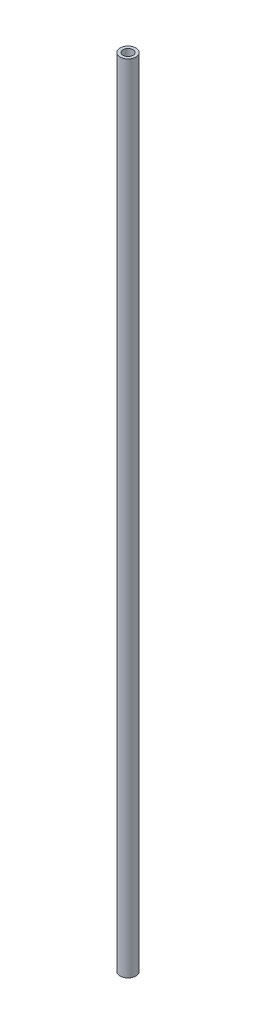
ISO-10303-21;
HEADER;
FILE_DESCRIPTION(('STEP AP214'),'2;1');
FILE_NAME('part.step','',(''),(''),'','','');
FILE_SCHEMA(('AUTOMOTIVE_DESIGN { 1 0 10303 214 1 1 1 1 }'));
ENDSEC;
DATA;
#1=APPLICATION_CONTEXT('core data for automotive mechanical design processes');
#2=APPLICATION_PROTOCOL_DEFINITION('international standard','automotive_design',2000,#1);
#3=PRODUCT_CONTEXT('',#1,'mechanical');
#4=PRODUCT('Part','Part','',(#3));
#5=PRODUCT_RELATED_PRODUCT_CATEGORY('part','',(#4));
#6=PRODUCT_DEFINITION_FORMATION('','',#4);
#7=PRODUCT_DEFINITION_CONTEXT('part definition',#1,'design');
#8=PRODUCT_DEFINITION('design','',#6,#7);
#9=PRODUCT_DEFINITION_SHAPE('','',#8);
#10=(LENGTH_UNIT() NAMED_UNIT(*) SI_UNIT(.MILLI.,.METRE.));
#11=(NAMED_UNIT(*) PLANE_ANGLE_UNIT() SI_UNIT($,.RADIAN.));
#12=(NAMED_UNIT(*) SI_UNIT($,.STERADIAN.) SOLID_ANGLE_UNIT());
#13=UNCERTAINTY_MEASURE_WITH_UNIT(LENGTH_MEASURE(1.E-05),#10,'distance_accuracy_value','');
#14=(GEOMETRIC_REPRESENTATION_CONTEXT(3) GLOBAL_UNCERTAINTY_ASSIGNED_CONTEXT((#13)) GLOBAL_UNIT_ASSIGNED_CONTEXT((#10,
#11,#12)) REPRESENTATION_CONTEXT('',''));
#15=CARTESIAN_POINT('',(0.,0.,0.));
#16=DIRECTION('',(0.,0.,1.));
#17=DIRECTION('',(1.,0.,0.));
#18=AXIS2_PLACEMENT_3D('',#15,#16,#17);
#19=CARTESIAN_POINT('',(0.,400.,0.));
#20=DIRECTION('',(0.,-1.,0.));
#21=DIRECTION('',(0.,0.,-1.));
#22=AXIS2_PLACEMENT_3D('',#19,#20,#21);
#23=CYLINDRICAL_SURFACE('',#22,4.);
#24=CARTESIAN_POINT('',(0.,400.,0.));
#25=DIRECTION('',(0.,1.,0.));
#26=DIRECTION('',(0.,0.,1.));
#27=AXIS2_PLACEMENT_3D('',#24,#25,#26);
#28=CIRCLE('',#27,4.);
#29=CARTESIAN_POINT('',(0.,400.,4.));
#30=VERTEX_POINT('',#29);
#31=EDGE_CURVE('E10',#30,#30,#28,.T.);
#32=ORIENTED_EDGE('',*,*,#31,.F.);
#33=EDGE_LOOP('',(#32));
#34=FACE_BOUND('',#33,.T.);
#35=CARTESIAN_POINT('',(0.,0.,0.));
#36=DIRECTION('',(0.,1.,0.));
#37=DIRECTION('',(0.,0.,1.));
#38=AXIS2_PLACEMENT_3D('',#35,#36,#37);
#39=CIRCLE('',#38,4.);
#40=CARTESIAN_POINT('',(0.,0.,4.));
#41=VERTEX_POINT('',#40);
#42=EDGE_CURVE('E43',#41,#41,#39,.T.);
#43=ORIENTED_EDGE('',*,*,#42,.T.);
#44=EDGE_LOOP('',(#43));
#45=FACE_BOUND('',#44,.T.);
#46=ADVANCED_FACE('F40',(#34,#45),#23,.T.);
#47=CARTESIAN_POINT('',(0.,400.,0.));
#48=DIRECTION('',(0.,1.,0.));
#49=DIRECTION('',(0.,0.,1.));
#50=AXIS2_PLACEMENT_3D('',#47,#48,#49);
#51=PLANE('',#50);
#52=CARTESIAN_POINT('',(0.,400.,0.));
#53=DIRECTION('',(0.,1.,0.));
#54=DIRECTION('',(0.,0.,1.));
#55=AXIS2_PLACEMENT_3D('',#52,#53,#54);
#56=CIRCLE('',#55,2.5);
#57=CARTESIAN_POINT('',(0.,400.,2.5));
#58=VERTEX_POINT('',#57);
#59=EDGE_CURVE('E52',#58,#58,#56,.T.);
#60=ORIENTED_EDGE('',*,*,#59,.F.);
#61=EDGE_LOOP('',(#60));
#62=FACE_BOUND('',#61,.T.);
#63=ORIENTED_EDGE('',*,*,#31,.T.);
#64=EDGE_LOOP('',(#63));
#65=FACE_BOUND('',#64,.T.);
#66=ADVANCED_FACE('F67',(#62,#65),#51,.T.);
#67=CARTESIAN_POINT('',(0.,0.,0.));
#68=DIRECTION('',(0.,1.,0.));
#69=DIRECTION('',(0.,0.,1.));
#70=AXIS2_PLACEMENT_3D('',#67,#68,#69);
#71=PLANE('',#70);
#72=ORIENTED_EDGE('',*,*,#42,.F.);
#73=EDGE_LOOP('',(#72));
#74=FACE_BOUND('',#73,.T.);
#75=ADVANCED_FACE('F63',(#74),#71,.F.);
#76=CARTESIAN_POINT('',(0.,395.,0.));
#77=DIRECTION('',(0.,1.,0.));
#78=DIRECTION('',(0.,0.,1.));
#79=AXIS2_PLACEMENT_3D('',#76,#77,#78);
#80=CYLINDRICAL_SURFACE('',#79,2.5);
#81=CARTESIAN_POINT('',(0.,395.,0.));
#82=DIRECTION('',(0.,1.,0.));
#83=DIRECTION('',(0.,0.,1.));
#84=AXIS2_PLACEMENT_3D('',#81,#82,#83);
#85=CIRCLE('',#84,2.5);
#86=CARTESIAN_POINT('',(0.,395.,2.5));
#87=VERTEX_POINT('',#86);
#88=EDGE_CURVE('E50',#87,#87,#85,.T.);
#89=ORIENTED_EDGE('',*,*,#88,.F.);
#90=EDGE_LOOP('',(#89));
#91=FACE_BOUND('',#90,.T.);
#92=ORIENTED_EDGE('',*,*,#59,.T.);
#93=EDGE_LOOP('',(#92));
#94=FACE_BOUND('',#93,.T.);
#95=ADVANCED_FACE('F60',(#91,#94),#80,.F.);
#96=CARTESIAN_POINT('',(0.,395.,0.));
#97=DIRECTION('',(0.,1.,0.));
#98=DIRECTION('',(0.,0.,1.));
#99=AXIS2_PLACEMENT_3D('',#96,#97,#98);
#100=PLANE('',#99);
#101=ORIENTED_EDGE('',*,*,#88,.T.);
#102=EDGE_LOOP('',(#101));
#103=FACE_BOUND('',#102,.T.);
#104=ADVANCED_FACE('F58',(#103),#100,.T.);
#105=CLOSED_SHELL('',(#46,#66,#75,#95,#104));
#106=MANIFOLD_SOLID_BREP('B2',#105);
#107=ADVANCED_BREP_SHAPE_REPRESENTATION('',(#18,#106),#14);
#108=SHAPE_DEFINITION_REPRESENTATION(#9,#107);
ENDSEC;
END-ISO-10303-21;
